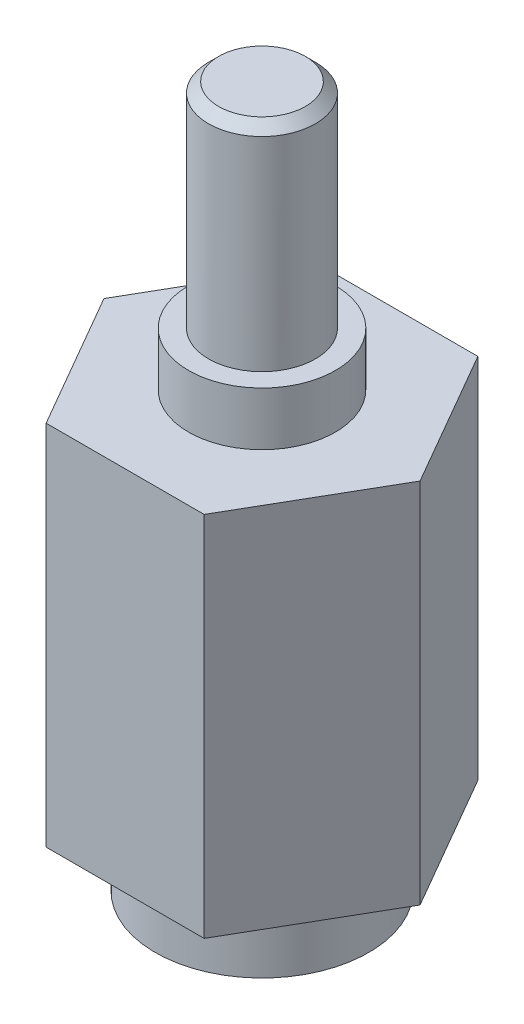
ISO-10303-21;
HEADER;
FILE_DESCRIPTION(('STEP AP214'),'2;1');
FILE_NAME('part.step','',(''),(''),'','','');
FILE_SCHEMA(('AUTOMOTIVE_DESIGN { 1 0 10303 214 1 1 1 1 }'));
ENDSEC;
DATA;
#1=APPLICATION_CONTEXT('core data for automotive mechanical design processes');
#2=APPLICATION_PROTOCOL_DEFINITION('international standard','automotive_design',2000,#1);
#3=PRODUCT_CONTEXT('',#1,'mechanical');
#4=PRODUCT('Part','Part','',(#3));
#5=PRODUCT_RELATED_PRODUCT_CATEGORY('part','',(#4));
#6=PRODUCT_DEFINITION_FORMATION('','',#4);
#7=PRODUCT_DEFINITION_CONTEXT('part definition',#1,'design');
#8=PRODUCT_DEFINITION('design','',#6,#7);
#9=PRODUCT_DEFINITION_SHAPE('','',#8);
#10=(LENGTH_UNIT() NAMED_UNIT(*) SI_UNIT(.MILLI.,.METRE.));
#11=(NAMED_UNIT(*) PLANE_ANGLE_UNIT() SI_UNIT($,.RADIAN.));
#12=(NAMED_UNIT(*) SI_UNIT($,.STERADIAN.) SOLID_ANGLE_UNIT());
#13=UNCERTAINTY_MEASURE_WITH_UNIT(LENGTH_MEASURE(1.E-05),#10,'distance_accuracy_value','');
#14=(GEOMETRIC_REPRESENTATION_CONTEXT(3) GLOBAL_UNCERTAINTY_ASSIGNED_CONTEXT((#13)) GLOBAL_UNIT_ASSIGNED_CONTEXT((#10,
#11,#12)) REPRESENTATION_CONTEXT('',''));
#15=CARTESIAN_POINT('',(0.,0.,0.));
#16=DIRECTION('',(0.,0.,1.));
#17=DIRECTION('',(1.,0.,0.));
#18=AXIS2_PLACEMENT_3D('',#15,#16,#17);
#19=CARTESIAN_POINT('',(20.0000000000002,64.9999999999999,0.));
#20=DIRECTION('',(0.,-1.,0.));
#21=DIRECTION('',(1.00000000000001,0.,0.));
#22=AXIS2_PLACEMENT_3D('',#19,#20,#21);
#23=PLANE('',#22);
#24=CARTESIAN_POINT('',(0.,64.9999999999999,0.));
#25=DIRECTION('',(0.,1.,0.));
#26=DIRECTION('',(-1.00000000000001,0.,0.));
#27=AXIS2_PLACEMENT_3D('',#24,#25,#26);
#28=CIRCLE('',#27,11.);
#29=CARTESIAN_POINT('',(-11.0000000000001,64.9999999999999,0.));
#30=VERTEX_POINT('',#29);
#31=EDGE_CURVE('E173',#30,#30,#28,.T.);
#32=ORIENTED_EDGE('',*,*,#31,.F.);
#33=EDGE_LOOP('',(#32));
#34=FACE_BOUND('',#33,.T.);
#35=DIRECTION('',(-0.500000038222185,0.,-0.866025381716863));
#36=VECTOR('',#35,1.);
#37=CARTESIAN_POINT('',(11.8356799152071,64.9999999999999,-20.4999999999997));
#38=LINE('',#37,#36);
#39=CARTESIAN_POINT('',(23.6713616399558,64.9999999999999,1.80411241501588E-13));
#40=VERTEX_POINT('',#39);
#41=CARTESIAN_POINT('',(11.8356799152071,64.9999999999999,-20.4999999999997));
#42=VERTEX_POINT('',#41);
#43=EDGE_CURVE('E95',#40,#42,#38,.T.);
#44=ORIENTED_EDGE('',*,*,#43,.T.);
#45=DIRECTION('',(-1.00000000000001,0.,0.));
#46=VECTOR('',#45,1.);
#47=CARTESIAN_POINT('',(-11.8356799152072,64.9999999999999,-20.4999999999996));
#48=LINE('',#47,#46);
#49=CARTESIAN_POINT('',(-11.8356799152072,64.9999999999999,-20.4999999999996));
#50=VERTEX_POINT('',#49);
#51=EDGE_CURVE('E106',#42,#50,#48,.T.);
#52=ORIENTED_EDGE('',*,*,#51,.T.);
#53=DIRECTION('',(-0.500000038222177,0.,0.866025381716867));
#54=VECTOR('',#53,1.);
#55=CARTESIAN_POINT('',(-23.6713616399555,64.9999999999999,1.52655665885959E-13));
#56=LINE('',#55,#54);
#57=CARTESIAN_POINT('',(-23.6713616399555,64.9999999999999,1.52655665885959E-13));
#58=VERTEX_POINT('',#57);
#59=EDGE_CURVE('E112',#50,#58,#56,.T.);
#60=ORIENTED_EDGE('',*,*,#59,.T.);
#61=DIRECTION('',(0.500000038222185,0.,0.866025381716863));
#62=VECTOR('',#61,1.);
#63=CARTESIAN_POINT('',(-11.8356799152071,64.9999999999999,20.4999999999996));
#64=LINE('',#63,#62);
#65=CARTESIAN_POINT('',(-11.8356799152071,64.9999999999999,20.4999999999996));
#66=VERTEX_POINT('',#65);
#67=EDGE_CURVE('E123',#58,#66,#64,.T.);
#68=ORIENTED_EDGE('',*,*,#67,.T.);
#69=DIRECTION('',(1.00000000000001,0.,0.));
#70=VECTOR('',#69,1.);
#71=CARTESIAN_POINT('',(11.8356799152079,64.9999999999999,20.4999999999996));
#72=LINE('',#71,#70);
#73=CARTESIAN_POINT('',(11.8356799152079,64.9999999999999,20.4999999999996));
#74=VERTEX_POINT('',#73);
#75=EDGE_CURVE('E126',#66,#74,#72,.T.);
#76=ORIENTED_EDGE('',*,*,#75,.T.);
#77=DIRECTION('',(0.500000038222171,0.,-0.866025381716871));
#78=VECTOR('',#77,1.);
#79=CARTESIAN_POINT('',(23.6713616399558,64.9999999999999,1.80411241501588E-13));
#80=LINE('',#79,#78);
#81=EDGE_CURVE('E115',#74,#40,#80,.T.);
#82=ORIENTED_EDGE('',*,*,#81,.T.);
#83=EDGE_LOOP('',(#44,#52,#60,#68,#76,#82));
#84=FACE_BOUND('',#83,.T.);
#85=ADVANCED_FACE('F38',(#34,#84),#23,.F.);
#86=CARTESIAN_POINT('',(0.,105.,0.));
#87=DIRECTION('',(0.,1.,0.));
#88=DIRECTION('',(-1.00000000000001,0.,0.));
#89=AXIS2_PLACEMENT_3D('',#86,#87,#88);
#90=CYLINDRICAL_SURFACE('',#89,11.);
#91=CARTESIAN_POINT('',(0.,73.,0.));
#92=DIRECTION('',(0.,1.,0.));
#93=DIRECTION('',(-1.00000000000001,0.,0.));
#94=AXIS2_PLACEMENT_3D('',#91,#92,#93);
#95=CIRCLE('',#94,11.);
#96=CARTESIAN_POINT('',(-11.0000000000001,73.,0.));
#97=VERTEX_POINT('',#96);
#98=EDGE_CURVE('E169',#97,#97,#95,.T.);
#99=ORIENTED_EDGE('',*,*,#98,.F.);
#100=EDGE_LOOP('',(#99));
#101=FACE_BOUND('',#100,.T.);
#102=ORIENTED_EDGE('',*,*,#31,.T.);
#103=EDGE_LOOP('',(#102));
#104=FACE_BOUND('',#103,.T.);
#105=ADVANCED_FACE('F206',(#101,#104),#90,.T.);
#106=CARTESIAN_POINT('',(11.0000000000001,73.,0.));
#107=DIRECTION('',(0.,-1.,0.));
#108=DIRECTION('',(1.00000000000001,0.,0.));
#109=AXIS2_PLACEMENT_3D('',#106,#107,#108);
#110=PLANE('',#109);
#111=CARTESIAN_POINT('',(0.,73.,0.));
#112=DIRECTION('',(0.,1.,0.));
#113=DIRECTION('',(-1.00000000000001,0.,0.));
#114=AXIS2_PLACEMENT_3D('',#111,#112,#113);
#115=CIRCLE('',#114,8.);
#116=CARTESIAN_POINT('',(-8.00000000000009,73.,0.));
#117=VERTEX_POINT('',#116);
#118=EDGE_CURVE('E165',#117,#117,#115,.T.);
#119=ORIENTED_EDGE('',*,*,#118,.F.);
#120=EDGE_LOOP('',(#119));
#121=FACE_BOUND('',#120,.T.);
#122=ORIENTED_EDGE('',*,*,#98,.T.);
#123=EDGE_LOOP('',(#122));
#124=FACE_BOUND('',#123,.T.);
#125=ADVANCED_FACE('F212',(#121,#124),#110,.F.);
#126=CARTESIAN_POINT('',(0.,105.,0.));
#127=DIRECTION('',(0.,1.,0.));
#128=DIRECTION('',(-1.00000000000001,0.,0.));
#129=AXIS2_PLACEMENT_3D('',#126,#127,#128);
#130=CYLINDRICAL_SURFACE('',#129,8.);
#131=CARTESIAN_POINT('',(0.,103.5,0.));
#132=DIRECTION('',(0.,-1.,0.));
#133=DIRECTION('',(1.00000000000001,0.,0.));
#134=AXIS2_PLACEMENT_3D('',#131,#132,#133);
#135=CIRCLE('',#134,8.);
#136=CARTESIAN_POINT('',(8.00000000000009,103.5,0.));
#137=VERTEX_POINT('',#136);
#138=EDGE_CURVE('E11',#137,#137,#135,.T.);
#139=ORIENTED_EDGE('',*,*,#138,.T.);
#140=EDGE_LOOP('',(#139));
#141=FACE_BOUND('',#140,.T.);
#142=ORIENTED_EDGE('',*,*,#118,.T.);
#143=EDGE_LOOP('',(#142));
#144=FACE_BOUND('',#143,.T.);
#145=ADVANCED_FACE('F256',(#141,#144),#130,.T.);
#146=CARTESIAN_POINT('',(8.00000000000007,105.,0.));
#147=DIRECTION('',(0.,-1.,0.));
#148=DIRECTION('',(1.00000000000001,0.,0.));
#149=AXIS2_PLACEMENT_3D('',#146,#147,#148);
#150=PLANE('',#149);
#151=CARTESIAN_POINT('',(0.,105.,0.));
#152=DIRECTION('',(0.,-1.,0.));
#153=DIRECTION('',(1.00000000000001,0.,0.));
#154=AXIS2_PLACEMENT_3D('',#151,#152,#153);
#155=CIRCLE('',#154,6.5);
#156=CARTESIAN_POINT('',(6.50000000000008,105.,0.));
#157=VERTEX_POINT('',#156);
#158=EDGE_CURVE('E47',#157,#157,#155,.F.);
#159=ORIENTED_EDGE('',*,*,#158,.T.);
#160=EDGE_LOOP('',(#159));
#161=FACE_BOUND('',#160,.T.);
#162=ADVANCED_FACE('F191',(#161),#150,.F.);
#163=CARTESIAN_POINT('',(11.8356799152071,10.,-20.4999999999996));
#164=DIRECTION('',(0.866025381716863,0.,-0.500000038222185));
#165=DIRECTION('',(-0.500000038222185,0.,-0.866025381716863));
#166=AXIS2_PLACEMENT_3D('',#163,#164,#165);
#167=PLANE('',#166);
#168=ORIENTED_EDGE('',*,*,#43,.F.);
#169=DIRECTION('',(0.,1.,0.));
#170=VECTOR('',#169,1.);
#171=CARTESIAN_POINT('',(23.6713616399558,10.,1.80411241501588E-13));
#172=LINE('',#171,#170);
#173=CARTESIAN_POINT('',(23.6713616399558,10.,1.80411241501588E-13));
#174=VERTEX_POINT('',#173);
#175=EDGE_CURVE('E54',#174,#40,#172,.T.);
#176=ORIENTED_EDGE('',*,*,#175,.F.);
#177=DIRECTION('',(-0.500000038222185,0.,-0.866025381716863));
#178=VECTOR('',#177,1.);
#179=CARTESIAN_POINT('',(11.8356799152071,10.,-20.4999999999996));
#180=LINE('',#179,#178);
#181=CARTESIAN_POINT('',(11.8356799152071,10.,-20.4999999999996));
#182=VERTEX_POINT('',#181);
#183=EDGE_CURVE('E97',#174,#182,#180,.T.);
#184=ORIENTED_EDGE('',*,*,#183,.T.);
#185=DIRECTION('',(0.,1.,0.));
#186=VECTOR('',#185,1.);
#187=CARTESIAN_POINT('',(11.8356799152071,10.,-20.4999999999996));
#188=LINE('',#187,#186);
#189=EDGE_CURVE('E91',#182,#42,#188,.T.);
#190=ORIENTED_EDGE('',*,*,#189,.T.);
#191=EDGE_LOOP('',(#168,#176,#184,#190));
#192=FACE_BOUND('',#191,.T.);
#193=ADVANCED_FACE('F93',(#192),#167,.T.);
#194=CARTESIAN_POINT('',(23.6713616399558,10.,1.80411241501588E-13));
#195=DIRECTION('',(0.866025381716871,0.,0.500000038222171));
#196=DIRECTION('',(0.500000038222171,0.,-0.866025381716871));
#197=AXIS2_PLACEMENT_3D('',#194,#195,#196);
#198=PLANE('',#197);
#199=ORIENTED_EDGE('',*,*,#81,.F.);
#200=DIRECTION('',(0.,1.,0.));
#201=VECTOR('',#200,1.);
#202=CARTESIAN_POINT('',(11.8356799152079,10.,20.4999999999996));
#203=LINE('',#202,#201);
#204=CARTESIAN_POINT('',(11.8356799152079,10.,20.4999999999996));
#205=VERTEX_POINT('',#204);
#206=EDGE_CURVE('E62',#205,#74,#203,.T.);
#207=ORIENTED_EDGE('',*,*,#206,.F.);
#208=DIRECTION('',(0.500000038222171,0.,-0.866025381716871));
#209=VECTOR('',#208,1.);
#210=CARTESIAN_POINT('',(23.6713616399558,10.,1.80411241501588E-13));
#211=LINE('',#210,#209);
#212=EDGE_CURVE('E103',#205,#174,#211,.T.);
#213=ORIENTED_EDGE('',*,*,#212,.T.);
#214=ORIENTED_EDGE('',*,*,#175,.T.);
#215=EDGE_LOOP('',(#199,#207,#213,#214));
#216=FACE_BOUND('',#215,.T.);
#217=ADVANCED_FACE('F252',(#216),#198,.T.);
#218=CARTESIAN_POINT('',(11.8356799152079,10.,20.4999999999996));
#219=DIRECTION('',(0.,0.,1.00000000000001));
#220=DIRECTION('',(1.00000000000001,0.,0.));
#221=AXIS2_PLACEMENT_3D('',#218,#219,#220);
#222=PLANE('',#221);
#223=ORIENTED_EDGE('',*,*,#75,.F.);
#224=DIRECTION('',(0.,1.,0.));
#225=VECTOR('',#224,1.);
#226=CARTESIAN_POINT('',(-11.8356799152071,10.,20.4999999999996));
#227=LINE('',#226,#225);
#228=CARTESIAN_POINT('',(-11.8356799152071,10.,20.4999999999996));
#229=VERTEX_POINT('',#228);
#230=EDGE_CURVE('E154',#229,#66,#227,.T.);
#231=ORIENTED_EDGE('',*,*,#230,.F.);
#232=DIRECTION('',(1.00000000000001,0.,0.));
#233=VECTOR('',#232,1.);
#234=CARTESIAN_POINT('',(11.8356799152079,10.,20.4999999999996));
#235=LINE('',#234,#233);
#236=EDGE_CURVE('E144',#229,#205,#235,.T.);
#237=ORIENTED_EDGE('',*,*,#236,.T.);
#238=ORIENTED_EDGE('',*,*,#206,.T.);
#239=EDGE_LOOP('',(#223,#231,#237,#238));
#240=FACE_BOUND('',#239,.T.);
#241=ADVANCED_FACE('F289',(#240),#222,.T.);
#242=CARTESIAN_POINT('',(-11.8356799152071,10.,20.4999999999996));
#243=DIRECTION('',(-0.866025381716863,0.,0.500000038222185));
#244=DIRECTION('',(0.500000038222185,0.,0.866025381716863));
#245=AXIS2_PLACEMENT_3D('',#242,#243,#244);
#246=PLANE('',#245);
#247=ORIENTED_EDGE('',*,*,#67,.F.);
#248=DIRECTION('',(0.,1.,0.));
#249=VECTOR('',#248,1.);
#250=CARTESIAN_POINT('',(-23.6713616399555,10.,1.94289029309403E-13));
#251=LINE('',#250,#249);
#252=CARTESIAN_POINT('',(-23.6713616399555,10.,1.94289029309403E-13));
#253=VERTEX_POINT('',#252);
#254=EDGE_CURVE('E157',#253,#58,#251,.T.);
#255=ORIENTED_EDGE('',*,*,#254,.F.);
#256=DIRECTION('',(0.500000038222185,0.,0.866025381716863));
#257=VECTOR('',#256,1.);
#258=CARTESIAN_POINT('',(-11.8356799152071,10.,20.4999999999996));
#259=LINE('',#258,#257);
#260=EDGE_CURVE('E140',#253,#229,#259,.T.);
#261=ORIENTED_EDGE('',*,*,#260,.T.);
#262=ORIENTED_EDGE('',*,*,#230,.T.);
#263=EDGE_LOOP('',(#247,#255,#261,#262));
#264=FACE_BOUND('',#263,.T.);
#265=ADVANCED_FACE('F246',(#264),#246,.T.);
#266=CARTESIAN_POINT('',(-23.6713616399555,10.,1.94289029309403E-13));
#267=DIRECTION('',(-0.866025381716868,0.,-0.500000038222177));
#268=DIRECTION('',(-0.500000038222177,0.,0.866025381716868));
#269=AXIS2_PLACEMENT_3D('',#266,#267,#268);
#270=PLANE('',#269);
#271=ORIENTED_EDGE('',*,*,#59,.F.);
#272=DIRECTION('',(0.,1.,0.));
#273=VECTOR('',#272,1.);
#274=CARTESIAN_POINT('',(-11.8356799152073,10.,-20.4999999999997));
#275=LINE('',#274,#273);
#276=CARTESIAN_POINT('',(-11.8356799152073,10.,-20.4999999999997));
#277=VERTEX_POINT('',#276);
#278=EDGE_CURVE('E102',#277,#50,#275,.T.);
#279=ORIENTED_EDGE('',*,*,#278,.F.);
#280=DIRECTION('',(-0.500000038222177,0.,0.866025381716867));
#281=VECTOR('',#280,1.);
#282=CARTESIAN_POINT('',(-23.6713616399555,10.,1.94289029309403E-13));
#283=LINE('',#282,#281);
#284=EDGE_CURVE('E136',#277,#253,#283,.T.);
#285=ORIENTED_EDGE('',*,*,#284,.T.);
#286=ORIENTED_EDGE('',*,*,#254,.T.);
#287=EDGE_LOOP('',(#271,#279,#285,#286));
#288=FACE_BOUND('',#287,.T.);
#289=ADVANCED_FACE('F238',(#288),#270,.T.);
#290=CARTESIAN_POINT('',(-11.8356799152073,10.,-20.4999999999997));
#291=DIRECTION('',(0.,0.,-1.00000000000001));
#292=DIRECTION('',(-1.00000000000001,0.,0.));
#293=AXIS2_PLACEMENT_3D('',#290,#291,#292);
#294=PLANE('',#293);
#295=ORIENTED_EDGE('',*,*,#51,.F.);
#296=ORIENTED_EDGE('',*,*,#189,.F.);
#297=DIRECTION('',(-1.00000000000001,0.,0.));
#298=VECTOR('',#297,1.);
#299=CARTESIAN_POINT('',(-11.8356799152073,10.,-20.4999999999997));
#300=LINE('',#299,#298);
#301=EDGE_CURVE('E133',#182,#277,#300,.T.);
#302=ORIENTED_EDGE('',*,*,#301,.T.);
#303=ORIENTED_EDGE('',*,*,#278,.T.);
#304=EDGE_LOOP('',(#295,#296,#302,#303));
#305=FACE_BOUND('',#304,.T.);
#306=ADVANCED_FACE('F107',(#305),#294,.T.);
#307=CARTESIAN_POINT('',(0.,0.,0.));
#308=DIRECTION('',(0.,1.,0.));
#309=DIRECTION('',(-1.00000000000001,0.,0.));
#310=AXIS2_PLACEMENT_3D('',#307,#308,#309);
#311=PLANE('',#310);
#312=CARTESIAN_POINT('',(0.,0.,0.));
#313=DIRECTION('',(0.,-1.,0.));
#314=DIRECTION('',(0.,0.,-1.00000000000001));
#315=AXIS2_PLACEMENT_3D('',#312,#313,#314);
#316=CIRCLE('',#315,7.24999999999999);
#317=CARTESIAN_POINT('',(0.,0.,-7.25000000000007));
#318=VERTEX_POINT('',#317);
#319=EDGE_CURVE('E151',#318,#318,#316,.T.);
#320=ORIENTED_EDGE('',*,*,#319,.F.);
#321=EDGE_LOOP('',(#320));
#322=FACE_BOUND('',#321,.T.);
#323=CARTESIAN_POINT('',(0.,0.,0.));
#324=DIRECTION('',(0.,1.,0.));
#325=DIRECTION('',(-1.00000000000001,0.,0.));
#326=AXIS2_PLACEMENT_3D('',#323,#324,#325);
#327=CIRCLE('',#326,16.);
#328=CARTESIAN_POINT('',(-16.0000000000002,0.,0.));
#329=VERTEX_POINT('',#328);
#330=EDGE_CURVE('E181',#329,#329,#327,.T.);
#331=ORIENTED_EDGE('',*,*,#330,.F.);
#332=EDGE_LOOP('',(#331));
#333=FACE_BOUND('',#332,.T.);
#334=ADVANCED_FACE('F40',(#322,#333),#311,.F.);
#335=CARTESIAN_POINT('',(0.,0.,0.));
#336=DIRECTION('',(0.,-1.,0.));
#337=DIRECTION('',(0.,0.,-1.00000000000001));
#338=AXIS2_PLACEMENT_3D('',#335,#336,#337);
#339=CYLINDRICAL_SURFACE('',#338,7.24999999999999);
#340=ORIENTED_EDGE('',*,*,#319,.T.);
#341=EDGE_LOOP('',(#340));
#342=FACE_BOUND('',#341,.T.);
#343=CARTESIAN_POINT('',(0.,10.,0.));
#344=DIRECTION('',(0.,1.,0.));
#345=DIRECTION('',(0.,0.,1.00000000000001));
#346=AXIS2_PLACEMENT_3D('',#343,#344,#345);
#347=CIRCLE('',#346,7.24999999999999);
#348=CARTESIAN_POINT('',(0.,10.,7.25000000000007));
#349=VERTEX_POINT('',#348);
#350=EDGE_CURVE('E185',#349,#349,#347,.F.);
#351=ORIENTED_EDGE('',*,*,#350,.F.);
#352=EDGE_LOOP('',(#351));
#353=FACE_BOUND('',#352,.T.);
#354=ADVANCED_FACE('F222',(#342,#353),#339,.F.);
#355=CARTESIAN_POINT('',(0.,105.,0.));
#356=DIRECTION('',(0.,1.,0.));
#357=DIRECTION('',(-1.00000000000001,0.,0.));
#358=AXIS2_PLACEMENT_3D('',#355,#356,#357);
#359=CYLINDRICAL_SURFACE('',#358,16.);
#360=CARTESIAN_POINT('',(0.,10.,0.));
#361=DIRECTION('',(0.,1.,0.));
#362=DIRECTION('',(-1.00000000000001,0.,0.));
#363=AXIS2_PLACEMENT_3D('',#360,#361,#362);
#364=CIRCLE('',#363,16.);
#365=CARTESIAN_POINT('',(-16.0000000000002,10.,0.));
#366=VERTEX_POINT('',#365);
#367=EDGE_CURVE('E177',#366,#366,#364,.T.);
#368=ORIENTED_EDGE('',*,*,#367,.F.);
#369=EDGE_LOOP('',(#368));
#370=FACE_BOUND('',#369,.T.);
#371=ORIENTED_EDGE('',*,*,#330,.T.);
#372=EDGE_LOOP('',(#371));
#373=FACE_BOUND('',#372,.T.);
#374=ADVANCED_FACE('F219',(#370,#373),#359,.T.);
#375=CARTESIAN_POINT('',(16.0000000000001,10.,0.));
#376=DIRECTION('',(0.,1.,0.));
#377=DIRECTION('',(-1.00000000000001,0.,0.));
#378=AXIS2_PLACEMENT_3D('',#375,#376,#377);
#379=PLANE('',#378);
#380=ORIENTED_EDGE('',*,*,#367,.T.);
#381=EDGE_LOOP('',(#380));
#382=FACE_BOUND('',#381,.T.);
#383=ORIENTED_EDGE('',*,*,#183,.F.);
#384=ORIENTED_EDGE('',*,*,#212,.F.);
#385=ORIENTED_EDGE('',*,*,#236,.F.);
#386=ORIENTED_EDGE('',*,*,#260,.F.);
#387=ORIENTED_EDGE('',*,*,#284,.F.);
#388=ORIENTED_EDGE('',*,*,#301,.F.);
#389=EDGE_LOOP('',(#383,#384,#385,#386,#387,#388));
#390=FACE_BOUND('',#389,.T.);
#391=ADVANCED_FACE('F201',(#382,#390),#379,.F.);
#392=CARTESIAN_POINT('',(-1.11022302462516E-13,10.,-40.9999968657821));
#393=DIRECTION('',(0.,1.,0.));
#394=DIRECTION('',(0.,0.,1.00000000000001));
#395=AXIS2_PLACEMENT_3D('',#392,#393,#394);
#396=PLANE('',#395);
#397=ORIENTED_EDGE('',*,*,#350,.T.);
#398=EDGE_LOOP('',(#397));
#399=FACE_BOUND('',#398,.T.);
#400=ADVANCED_FACE('F195',(#399),#396,.F.);
#401=CARTESIAN_POINT('',(0.,105.,0.));
#402=DIRECTION('',(0.,-1.,0.));
#403=DIRECTION('',(1.00000000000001,0.,0.));
#404=AXIS2_PLACEMENT_3D('',#401,#402,#403);
#405=CONICAL_SURFACE('',#404,6.5,0.785398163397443);
#406=ORIENTED_EDGE('',*,*,#138,.F.);
#407=EDGE_LOOP('',(#406));
#408=FACE_BOUND('',#407,.T.);
#409=ORIENTED_EDGE('',*,*,#158,.F.);
#410=EDGE_LOOP('',(#409));
#411=FACE_BOUND('',#410,.T.);
#412=ADVANCED_FACE('F193',(#408,#411),#405,.T.);
#413=CLOSED_SHELL('',(#85,#105,#125,#145,#162,#193,#217,#241,#265,#289,#306,#334,#354,#374,#391,
#400,#412));
#414=MANIFOLD_SOLID_BREP('B2',#413);
#415=ADVANCED_BREP_SHAPE_REPRESENTATION('',(#18,#414),#14);
#416=SHAPE_DEFINITION_REPRESENTATION(#9,#415);
ENDSEC;
END-ISO-10303-21;
